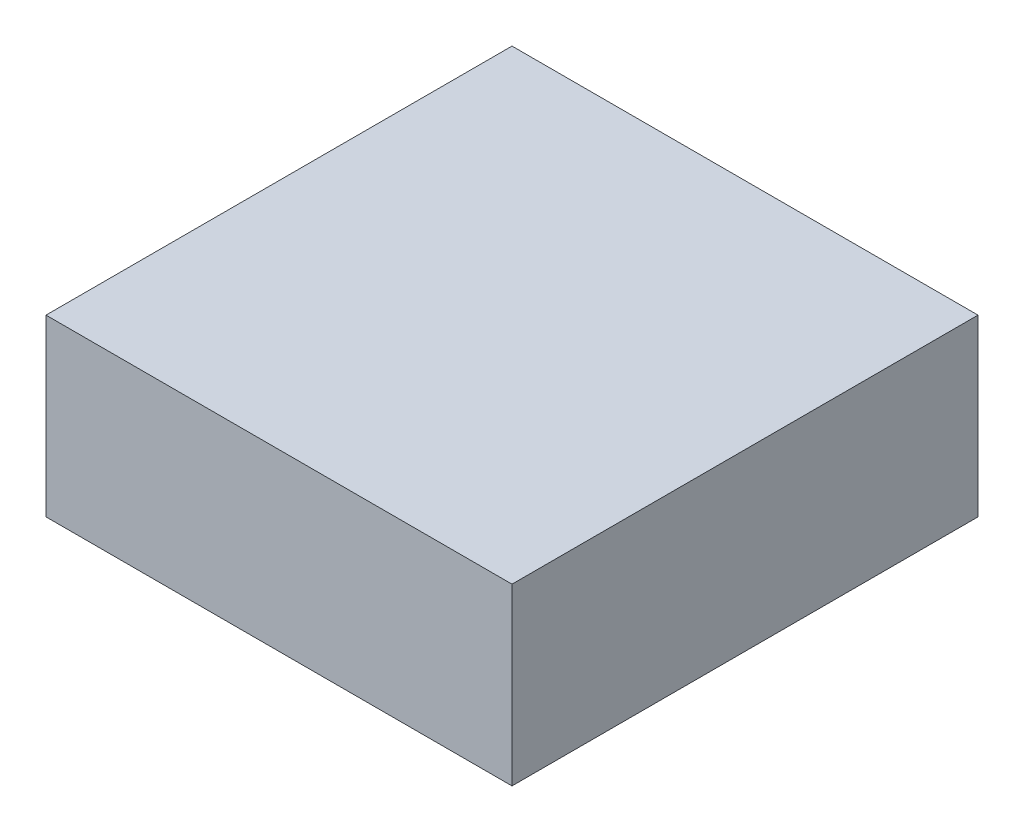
from build123d import *

# Parameters (mm, degrees)
SKIZZE1_W                       = 40
SKIZZE1_H                       = 15
AUFSATZ_LINEAR_AUSTRAGEN1_DEPTH = 40


with BuildPart() as part:
    # Skizze1 → Aufsatz-Linear austragen1 (new body)
    with BuildSketch(Plane.XY):
        with Locations((20, 7.5)):
            Rectangle(SKIZZE1_W, SKIZZE1_H)
    extrude(amount=AUFSATZ_LINEAR_AUSTRAGEN1_DEPTH)


solid = part.part
